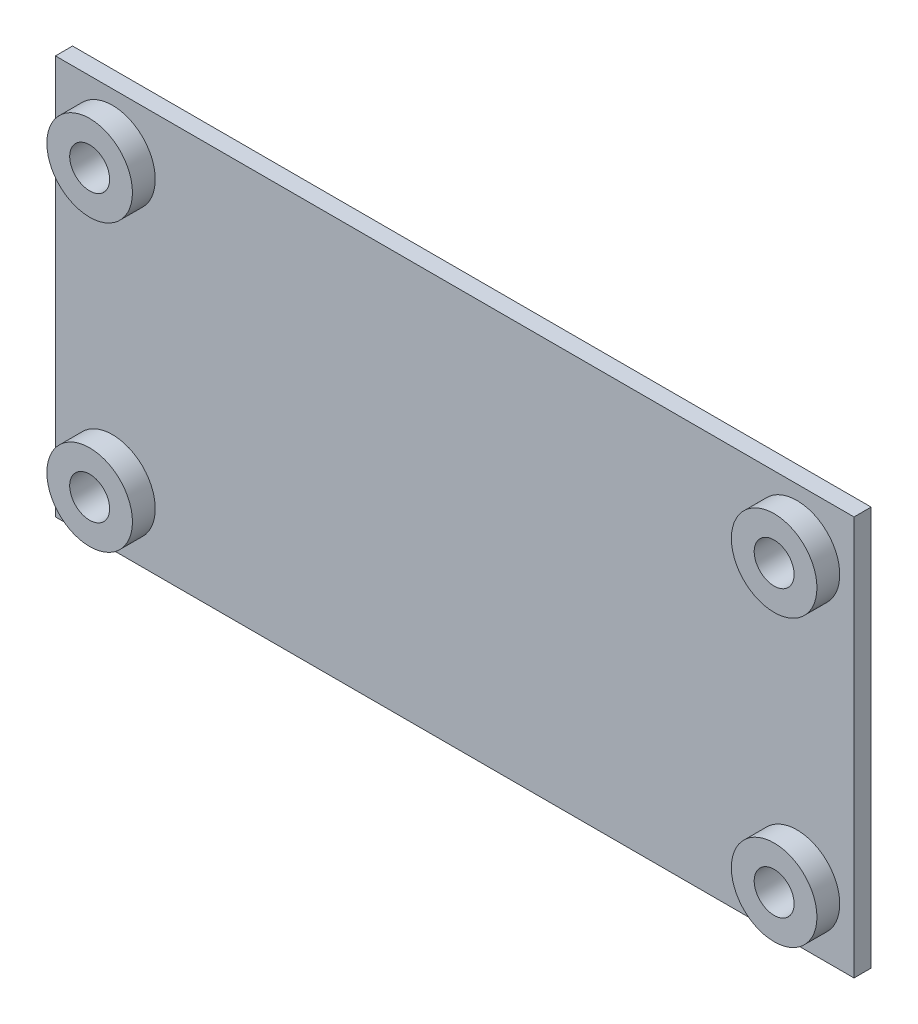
from build123d import *

# Parameters (mm, degrees)
ESQUISSE1_W        = 70
ESQUISSE1_H        = 35
ESQUISSE1_R        = 1.75
BOSS_EXTRU_1_DEPTH = 1.5
ESQUISSE2_R        = 3.75
ESQUISSE2_R_2      = 1.75
EXTRU_MINCE1_DEPTH = 2


with BuildPart() as part:
    # Esquisse1 → Boss.-Extru.1 (new body)
    with BuildSketch(Plane.XY):
        with Locations((35, 17.5)):
            Rectangle(ESQUISSE1_W, ESQUISSE1_H)
        with Locations((5, 5)):
            Circle(ESQUISSE1_R, mode=Mode.SUBTRACT)
        with Locations((5, 30)):
            Circle(ESQUISSE1_R, mode=Mode.SUBTRACT)
        with Locations((65, 30)):
            Circle(ESQUISSE1_R, mode=Mode.SUBTRACT)
        with Locations((65, 5)):
            Circle(ESQUISSE1_R, mode=Mode.SUBTRACT)
    extrude(amount=BOSS_EXTRU_1_DEPTH)

    # Esquisse2 → Extru.-Mince1 (add)
    # profile 1 of 4: a face of its own
    with BuildSketch(Plane.XY.offset(1.5)):
        with Locations((5, 30)):
            Circle(ESQUISSE2_R)
        with Locations((5, 30)):
            Circle(ESQUISSE2_R_2, mode=Mode.SUBTRACT)
    # profile 2 of 4: a face of its own
    with BuildSketch(Plane.XY.offset(1.5)):
        with Locations((5, 5)):
            Circle(ESQUISSE2_R)
        with Locations((5, 5)):
            Circle(ESQUISSE2_R_2, mode=Mode.SUBTRACT)
    # profile 3 of 4: a face of its own
    with BuildSketch(Plane.XY.offset(1.5)):
        with Locations((65, 5)):
            Circle(ESQUISSE2_R)
        with Locations((65, 5)):
            Circle(ESQUISSE2_R_2, mode=Mode.SUBTRACT)
    # profile 4 of 4: a face of its own
    with BuildSketch(Plane.XY.offset(1.5)):
        with Locations((65, 30)):
            Circle(ESQUISSE2_R)
        with Locations((65, 30)):
            Circle(ESQUISSE2_R_2, mode=Mode.SUBTRACT)
    extrude(amount=EXTRU_MINCE1_DEPTH)


solid = part.part
